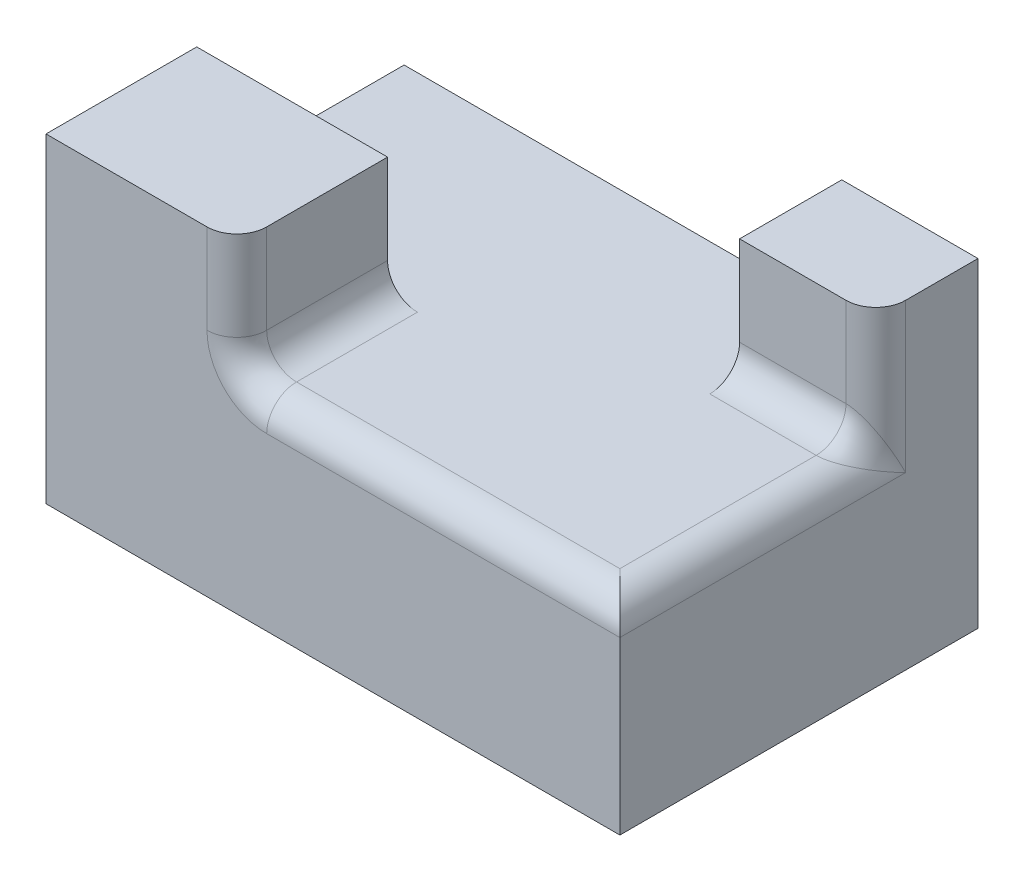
ISO-10303-21;
HEADER;
FILE_DESCRIPTION(('STEP AP214'),'2;1');
FILE_NAME('part.step','',(''),(''),'','','');
FILE_SCHEMA(('AUTOMOTIVE_DESIGN { 1 0 10303 214 1 1 1 1 }'));
ENDSEC;
DATA;
#1=APPLICATION_CONTEXT('core data for automotive mechanical design processes');
#2=APPLICATION_PROTOCOL_DEFINITION('international standard','automotive_design',2000,#1);
#3=PRODUCT_CONTEXT('',#1,'mechanical');
#4=PRODUCT('Part','Part','',(#3));
#5=PRODUCT_RELATED_PRODUCT_CATEGORY('part','',(#4));
#6=PRODUCT_DEFINITION_FORMATION('','',#4);
#7=PRODUCT_DEFINITION_CONTEXT('part definition',#1,'design');
#8=PRODUCT_DEFINITION('design','',#6,#7);
#9=PRODUCT_DEFINITION_SHAPE('','',#8);
#10=(LENGTH_UNIT() NAMED_UNIT(*) SI_UNIT(.MILLI.,.METRE.));
#11=(NAMED_UNIT(*) PLANE_ANGLE_UNIT() SI_UNIT($,.RADIAN.));
#12=(NAMED_UNIT(*) SI_UNIT($,.STERADIAN.) SOLID_ANGLE_UNIT());
#13=UNCERTAINTY_MEASURE_WITH_UNIT(LENGTH_MEASURE(1.E-05),#10,'distance_accuracy_value','');
#14=(GEOMETRIC_REPRESENTATION_CONTEXT(3) GLOBAL_UNCERTAINTY_ASSIGNED_CONTEXT((#13)) GLOBAL_UNIT_ASSIGNED_CONTEXT((#10,
#11,#12)) REPRESENTATION_CONTEXT('',''));
#15=CARTESIAN_POINT('',(0.,0.,0.));
#16=DIRECTION('',(0.,0.,1.));
#17=DIRECTION('',(1.,0.,0.));
#18=AXIS2_PLACEMENT_3D('',#15,#16,#17);
#19=CARTESIAN_POINT('',(96.1490143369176,28.6618279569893,12.1202496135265));
#20=CARTESIAN_POINT('',(96.1490143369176,28.6618279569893,12.1202496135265));
#21=CARTESIAN_POINT('',(96.1490143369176,28.6618279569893,12.1202496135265));
#22=CARTESIAN_POINT('',(96.1490080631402,28.7707616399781,12.3381169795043));
#23=CARTESIAN_POINT('',(96.1490377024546,28.8252281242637,12.283649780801));
#24=CARTESIAN_POINT('',(96.1490080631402,28.879695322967,12.2291832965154));
#25=CARTESIAN_POINT('',(96.1454544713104,28.8796796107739,12.5559529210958));
#26=CARTESIAN_POINT('',(96.1418871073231,28.9887210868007,12.447142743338));
#27=CARTESIAN_POINT('',(96.1454544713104,29.0975312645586,12.3381012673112));
#28=CARTESIAN_POINT('',(96.1312103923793,29.0972907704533,12.9911752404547));
#29=CARTESIAN_POINT('',(96.1134165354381,29.3144399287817,12.772861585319));
#30=CARTESIAN_POINT('',(96.1312103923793,29.5327535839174,12.5557124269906));
#31=CARTESIAN_POINT('',(96.1205193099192,29.2059839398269,13.2085615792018));
#32=CARTESIAN_POINT('',(96.0920548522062,29.4768961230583,12.9353177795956));
#33=CARTESIAN_POINT('',(96.1205193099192,29.7501399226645,12.6644055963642));
#34=CARTESIAN_POINT('',(96.0779288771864,29.5294979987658,13.8555896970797));
#35=CARTESIAN_POINT('',(96.0070926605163,29.958646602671,13.4170682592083));
#36=CARTESIAN_POINT('',(96.0779288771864,30.3971680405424,12.9879196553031));
#37=CARTESIAN_POINT('',(96.0355125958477,29.7436796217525,14.283952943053));
#38=CARTESIAN_POINT('',(95.9223415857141,30.2752082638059,13.7336299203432));
#39=CARTESIAN_POINT('',(96.0355125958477,30.8255312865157,13.2021012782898));
#40=CARTESIAN_POINT('',(95.9227282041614,30.1646067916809,15.1258072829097));
#41=CARTESIAN_POINT('',(95.7008351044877,30.8841688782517,14.342590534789));
#42=CARTESIAN_POINT('',(95.9227282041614,31.6673856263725,13.6230284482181));
#43=CARTESIAN_POINT('',(95.852840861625,30.3714168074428,15.5394273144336));
#44=CARTESIAN_POINT('',(95.5637556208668,31.1783980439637,14.636819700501));
#45=CARTESIAN_POINT('',(95.852840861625,32.0810056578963,13.8298384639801));
#46=CARTESIAN_POINT('',(95.6860629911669,30.7740522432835,16.344698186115));
#47=CARTESIAN_POINT('',(95.244452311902,31.7320304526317,15.190452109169));
#48=CARTESIAN_POINT('',(95.6860629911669,32.8862765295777,14.2324738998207));
#49=CARTESIAN_POINT('',(95.5898800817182,30.9700227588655,16.7366392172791));
#50=CARTESIAN_POINT('',(95.0617453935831,31.9932055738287,15.451627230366));
#51=CARTESIAN_POINT('',(95.5898800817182,33.2782175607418,14.4284444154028));
#52=CARTESIAN_POINT('',(95.3719274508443,31.3475279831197,17.4916496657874));
#53=CARTESIAN_POINT('',(94.661515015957,32.4707340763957,15.9291557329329));
#54=CARTESIAN_POINT('',(95.3719274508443,34.0332280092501,14.805949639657));
#55=CARTESIAN_POINT('',(95.2510696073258,31.5293236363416,17.8552409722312));
#56=CARTESIAN_POINT('',(94.4433664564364,32.6887553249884,16.1471769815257));
#57=CARTESIAN_POINT('',(95.2510696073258,34.3968193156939,14.9877452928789));
#58=CARTESIAN_POINT('',(94.985632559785,31.8752478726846,18.5470894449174));
#59=CARTESIAN_POINT('',(93.9867474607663,33.0715758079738,16.529997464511));
#60=CARTESIAN_POINT('',(94.985632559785,35.0886677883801,15.3336695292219));
#61=CARTESIAN_POINT('',(94.8421290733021,32.0397852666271,18.8761642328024));
#62=CARTESIAN_POINT('',(93.7475519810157,33.2378779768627,16.6962996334));
#63=CARTESIAN_POINT('',(94.8421290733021,35.4177425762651,15.4982069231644));
#64=CARTESIAN_POINT('',(94.5336806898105,32.348225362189,19.4930444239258));
#65=CARTESIAN_POINT('',(93.2679895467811,33.5118870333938,16.9703086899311));
#66=CARTESIAN_POINT('',(94.5336806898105,36.0346227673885,15.8066470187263));
#67=CARTESIAN_POINT('',(94.3699096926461,32.4927085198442,19.7820107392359));
#68=CARTESIAN_POINT('',(93.0268733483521,33.6208675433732,17.0792891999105));
#69=CARTESIAN_POINT('',(94.3699096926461,36.3235890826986,15.9511301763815));
#70=CARTESIAN_POINT('',(94.0236930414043,32.7583729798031,20.3133396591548));
#71=CARTESIAN_POINT('',(92.5666913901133,33.7802352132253,17.2386568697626));
#72=CARTESIAN_POINT('',(94.0236930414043,36.8549180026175,16.2167946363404));
#73=CARTESIAN_POINT('',(93.8424176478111,32.8803097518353,20.5572132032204));
#74=CARTESIAN_POINT('',(92.3469605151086,33.831617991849,17.2900396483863));
#75=CARTESIAN_POINT('',(93.8424176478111,37.0987915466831,16.3387314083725));
#76=CARTESIAN_POINT('',(93.4641525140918,33.0986694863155,20.9939326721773));
#77=CARTESIAN_POINT('',(91.9539994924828,33.8839523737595,17.3423740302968));
#78=CARTESIAN_POINT('',(93.4641525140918,37.53551101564,16.5570911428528));
#79=CARTESIAN_POINT('',(93.2682103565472,33.1959814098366,21.1885565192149));
#80=CARTESIAN_POINT('',(91.7802865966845,33.8856184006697,17.344040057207));
#81=CARTESIAN_POINT('',(93.2682103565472,37.7301348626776,16.6544030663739));
#82=CARTESIAN_POINT('',(92.9634821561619,33.3222155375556,21.4410247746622));
#83=CARTESIAN_POINT('',(91.5679602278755,33.8642822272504,17.3227038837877));
#84=CARTESIAN_POINT('',(92.9634821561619,37.9826031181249,16.7806371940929));
#85=CARTESIAN_POINT('',(92.862258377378,33.3604151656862,21.517424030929));
#86=CARTESIAN_POINT('',(91.5057132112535,33.853419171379,17.3118408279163));
#87=CARTESIAN_POINT('',(92.862258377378,38.0590023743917,16.8188368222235));
#88=CARTESIAN_POINT('',(92.6556569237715,33.430675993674,21.6579456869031));
#89=CARTESIAN_POINT('',(91.3965943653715,33.8268596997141,17.2852813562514));
#90=CARTESIAN_POINT('',(92.6556569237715,38.1995240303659,16.8890976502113));
#91=CARTESIAN_POINT('',(92.5502812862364,33.4627401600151,21.7220740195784));
#92=CARTESIAN_POINT('',(91.3499908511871,33.8111282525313,17.2695499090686));
#93=CARTESIAN_POINT('',(92.5502812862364,38.2636523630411,16.9211618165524));
#94=CARTESIAN_POINT('',(92.3390935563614,33.5193284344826,21.8352505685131));
#95=CARTESIAN_POINT('',(91.2737685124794,33.7785309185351,17.2369525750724));
#96=CARTESIAN_POINT('',(92.3390935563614,38.3768289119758,16.9777500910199));
#97=CARTESIAN_POINT('',(92.2333856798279,33.5440467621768,21.8846872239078));
#98=CARTESIAN_POINT('',(91.2439084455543,33.7617235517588,17.2201452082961));
#99=CARTESIAN_POINT('',(92.2333856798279,38.4262655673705,17.0024684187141));
#100=CARTESIAN_POINT('',(92.0193127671,33.5867119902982,21.9700176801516));
#101=CARTESIAN_POINT('',(91.1978030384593,33.7298203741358,17.1882420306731));
#102=CARTESIAN_POINT('',(92.0193127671,38.5115960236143,17.0451336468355));
#103=CARTESIAN_POINT('',(91.910949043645,33.6046621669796,22.005918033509));
#104=CARTESIAN_POINT('',(91.1817160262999,33.7147753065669,17.1731969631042));
#105=CARTESIAN_POINT('',(91.910949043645,38.5474963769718,17.0630838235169));
#106=CARTESIAN_POINT('',(91.6941005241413,33.6332107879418,22.0630152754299));
#107=CARTESIAN_POINT('',(91.1601582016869,33.6895473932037,17.147969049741));
#108=CARTESIAN_POINT('',(91.6941005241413,38.6045936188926,17.0916324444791));
#109=CARTESIAN_POINT('',(91.5856457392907,33.6439228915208,22.0844394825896));
#110=CARTESIAN_POINT('',(91.1546045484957,33.6793472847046,17.1377689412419));
#111=CARTESIAN_POINT('',(91.5856457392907,38.6260178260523,17.1023445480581));
#112=CARTESIAN_POINT('',(91.3677987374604,33.6582314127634,22.1130565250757));
#113=CARTESIAN_POINT('',(91.1490230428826,33.66546856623,17.1238902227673));
#114=CARTESIAN_POINT('',(91.3677987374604,38.6546348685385,17.1166530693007));
#115=CARTESIAN_POINT('',(91.258406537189,33.6618279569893,22.1202496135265));
#116=CARTESIAN_POINT('',(91.149018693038,33.6618279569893,17.1202496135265));
#117=CARTESIAN_POINT('',(91.258406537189,38.6618279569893,17.1202496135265));
#118=CARTESIAN_POINT('',(91.0396221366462,33.6618279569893,22.1202496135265));
#119=CARTESIAN_POINT('',(91.1490099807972,33.6618279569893,17.1202496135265));
#120=CARTESIAN_POINT('',(91.0396221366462,38.6618279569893,17.1202496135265));
#121=CARTESIAN_POINT('',(90.9302299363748,33.6582314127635,22.1130565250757));
#122=CARTESIAN_POINT('',(91.1490056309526,33.66546856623,17.1238902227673));
#123=CARTESIAN_POINT('',(90.9302299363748,38.6546348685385,17.1166530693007));
#124=CARTESIAN_POINT('',(90.7123829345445,33.6439228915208,22.0844394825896));
#125=CARTESIAN_POINT('',(91.1434241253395,33.6793472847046,17.1377689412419));
#126=CARTESIAN_POINT('',(90.7123829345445,38.6260178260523,17.1023445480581));
#127=CARTESIAN_POINT('',(90.6039281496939,33.6332107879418,22.0630152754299));
#128=CARTESIAN_POINT('',(91.1378704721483,33.6895473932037,17.147969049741));
#129=CARTESIAN_POINT('',(90.6039281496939,38.6045936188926,17.0916324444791));
#130=CARTESIAN_POINT('',(90.3870796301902,33.6046621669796,22.005918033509));
#131=CARTESIAN_POINT('',(91.1163126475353,33.7147753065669,17.1731969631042));
#132=CARTESIAN_POINT('',(90.3870796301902,38.5474963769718,17.0630838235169));
#133=CARTESIAN_POINT('',(90.2787159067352,33.5867119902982,21.9700176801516));
#134=CARTESIAN_POINT('',(91.1002256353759,33.7298203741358,17.1882420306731));
#135=CARTESIAN_POINT('',(90.2787159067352,38.5115960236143,17.0451336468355));
#136=CARTESIAN_POINT('',(90.0646429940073,33.5440467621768,21.8846872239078));
#137=CARTESIAN_POINT('',(91.0541202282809,33.7617235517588,17.2201452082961));
#138=CARTESIAN_POINT('',(90.0646429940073,38.4262655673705,17.0024684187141));
#139=CARTESIAN_POINT('',(89.9589351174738,33.5193284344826,21.8352505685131));
#140=CARTESIAN_POINT('',(91.0242601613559,33.7785309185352,17.2369525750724));
#141=CARTESIAN_POINT('',(89.9589351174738,38.3768289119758,16.9777500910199));
#142=CARTESIAN_POINT('',(89.7477473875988,33.4627401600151,21.7220740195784));
#143=CARTESIAN_POINT('',(90.9480378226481,33.8111282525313,17.2695499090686));
#144=CARTESIAN_POINT('',(89.7477473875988,38.2636523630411,16.9211618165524));
#145=CARTESIAN_POINT('',(89.6423717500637,33.430675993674,21.6579456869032));
#146=CARTESIAN_POINT('',(90.9014343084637,33.8268596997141,17.2852813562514));
#147=CARTESIAN_POINT('',(89.6423717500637,38.1995240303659,16.8890976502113));
#148=CARTESIAN_POINT('',(89.4357702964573,33.3604151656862,21.517424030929));
#149=CARTESIAN_POINT('',(90.7923154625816,33.853419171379,17.3118408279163));
#150=CARTESIAN_POINT('',(89.4357702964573,38.0590023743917,16.8188368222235));
#151=CARTESIAN_POINT('',(89.3345465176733,33.3222155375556,21.4410247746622));
#152=CARTESIAN_POINT('',(90.7300684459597,33.8642822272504,17.3227038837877));
#153=CARTESIAN_POINT('',(89.3345465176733,37.9826031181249,16.7806371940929));
#154=CARTESIAN_POINT('',(89.029818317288,33.1959814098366,21.1885565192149));
#155=CARTESIAN_POINT('',(90.5177420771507,33.8856184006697,17.344040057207));
#156=CARTESIAN_POINT('',(89.029818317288,37.7301348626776,16.6544030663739));
#157=CARTESIAN_POINT('',(88.8338761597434,33.0986694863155,20.9939326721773));
#158=CARTESIAN_POINT('',(90.3440291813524,33.8839523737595,17.3423740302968));
#159=CARTESIAN_POINT('',(88.8338761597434,37.53551101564,16.5570911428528));
#160=CARTESIAN_POINT('',(88.4556110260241,32.8803097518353,20.5572132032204));
#161=CARTESIAN_POINT('',(89.9510681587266,33.831617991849,17.2900396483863));
#162=CARTESIAN_POINT('',(88.4556110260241,37.0987915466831,16.3387314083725));
#163=CARTESIAN_POINT('',(88.2743356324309,32.7583729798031,20.3133396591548));
#164=CARTESIAN_POINT('',(89.7313372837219,33.7802352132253,17.2386568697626));
#165=CARTESIAN_POINT('',(88.2743356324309,36.8549180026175,16.2167946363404));
#166=CARTESIAN_POINT('',(87.9281189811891,32.4927085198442,19.7820107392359));
#167=CARTESIAN_POINT('',(89.2711553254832,33.6208675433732,17.0792891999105));
#168=CARTESIAN_POINT('',(87.9281189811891,36.3235890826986,15.9511301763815));
#169=CARTESIAN_POINT('',(87.7643479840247,32.348225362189,19.4930444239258));
#170=CARTESIAN_POINT('',(89.0300391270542,33.5118870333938,16.9703086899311));
#171=CARTESIAN_POINT('',(87.7643479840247,36.0346227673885,15.8066470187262));
#172=CARTESIAN_POINT('',(87.4558996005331,32.0397852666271,18.8761642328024));
#173=CARTESIAN_POINT('',(88.5504766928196,33.2378779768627,16.6962996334));
#174=CARTESIAN_POINT('',(87.4558996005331,35.4177425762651,15.4982069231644));
#175=CARTESIAN_POINT('',(87.3123961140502,31.8752478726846,18.5470894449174));
#176=CARTESIAN_POINT('',(88.3112812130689,33.0715758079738,16.529997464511));
#177=CARTESIAN_POINT('',(87.3123961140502,35.0886677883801,15.3336695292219));
#178=CARTESIAN_POINT('',(87.0469590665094,31.5293236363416,17.8552409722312));
#179=CARTESIAN_POINT('',(87.8546622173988,32.6887553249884,16.1471769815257));
#180=CARTESIAN_POINT('',(87.0469590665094,34.3968193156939,14.9877452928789));
#181=CARTESIAN_POINT('',(86.9261012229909,31.3475279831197,17.4916496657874));
#182=CARTESIAN_POINT('',(87.6365136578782,32.4707340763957,15.929155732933));
#183=CARTESIAN_POINT('',(86.9261012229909,34.0332280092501,14.805949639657));
#184=CARTESIAN_POINT('',(86.708148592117,30.9700227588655,16.7366392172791));
#185=CARTESIAN_POINT('',(87.2362832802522,31.9932055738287,15.451627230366));
#186=CARTESIAN_POINT('',(86.708148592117,33.2782175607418,14.4284444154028));
#187=CARTESIAN_POINT('',(86.6119656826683,30.7740522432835,16.344698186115));
#188=CARTESIAN_POINT('',(87.0535763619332,31.7320304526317,15.190452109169));
#189=CARTESIAN_POINT('',(86.6119656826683,32.8862765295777,14.2324738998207));
#190=CARTESIAN_POINT('',(86.4451878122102,30.3714168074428,15.5394273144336));
#191=CARTESIAN_POINT('',(86.7342730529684,31.1783980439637,14.636819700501));
#192=CARTESIAN_POINT('',(86.4451878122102,32.0810056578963,13.8298384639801));
#193=CARTESIAN_POINT('',(86.3753004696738,30.1646067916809,15.1258072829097));
#194=CARTESIAN_POINT('',(86.5971935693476,30.8841688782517,14.342590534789));
#195=CARTESIAN_POINT('',(86.3753004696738,31.6673856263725,13.6230284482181));
#196=CARTESIAN_POINT('',(86.2625160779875,29.7436796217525,14.283952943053));
#197=CARTESIAN_POINT('',(86.3756870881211,30.2752082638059,13.7336299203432));
#198=CARTESIAN_POINT('',(86.2625160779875,30.8255312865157,13.2021012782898));
#199=CARTESIAN_POINT('',(86.2200997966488,29.5294979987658,13.8555896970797));
#200=CARTESIAN_POINT('',(86.2909360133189,29.958646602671,13.4170682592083));
#201=CARTESIAN_POINT('',(86.2200997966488,30.3971680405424,12.9879196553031));
#202=CARTESIAN_POINT('',(86.177509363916,29.2059839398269,13.2085615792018));
#203=CARTESIAN_POINT('',(86.205973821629,29.4768961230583,12.9353177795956));
#204=CARTESIAN_POINT('',(86.177509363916,29.7501399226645,12.6644055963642));
#205=CARTESIAN_POINT('',(86.1668182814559,29.0972907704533,12.9911752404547));
#206=CARTESIAN_POINT('',(86.1846121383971,29.3144399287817,12.772861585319));
#207=CARTESIAN_POINT('',(86.1668182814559,29.5327535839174,12.5557124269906));
#208=CARTESIAN_POINT('',(86.1525742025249,28.8796796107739,12.5559529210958));
#209=CARTESIAN_POINT('',(86.156141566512,28.9887210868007,12.447142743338));
#210=CARTESIAN_POINT('',(86.1525742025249,29.0975312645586,12.3381012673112));
#211=CARTESIAN_POINT('',(86.149020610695,28.7707616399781,12.3381169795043));
#212=CARTESIAN_POINT('',(86.1489909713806,28.8252281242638,12.283649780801));
#213=CARTESIAN_POINT('',(86.149020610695,28.879695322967,12.2291832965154));
#214=CARTESIAN_POINT('',(86.1490143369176,28.6618279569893,12.1202496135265));
#215=CARTESIAN_POINT('',(86.1490143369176,28.6618279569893,12.1202496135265));
#216=CARTESIAN_POINT('',(86.1490143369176,28.6618279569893,12.1202496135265));
#217=(BOUNDED_SURFACE() B_SPLINE_SURFACE(3,2,((#19,#20,#21),(#22,#23,#24),(#25,#26,#27),(#28,
#29,#30),(#31,#32,#33),(#34,#35,#36),(#37,#38,#39),(#40,#41,#42),(#43,#44,#45),(#46,#47,#48),
(#49,#50,#51),(#52,#53,#54),(#55,#56,#57),(#58,#59,#60),(#61,#62,#63),(#64,#65,#66),(#67,#68,
#69),(#70,#71,#72),(#73,#74,#75),(#76,#77,#78),(#79,#80,#81),(#82,#83,#84),(#85,#86,#87),(#88,
#89,#90),(#91,#92,#93),(#94,#95,#96),(#97,#98,#99),(#100,#101,#102),(#103,#104,#105),(#106,#107,
#108),(#109,#110,#111),(#112,#113,#114),(#115,#116,#117),(#118,#119,#120),(#121,#122,#123),
(#124,#125,#126),(#127,#128,#129),(#130,#131,#132),(#133,#134,#135),(#136,#137,#138),(#139,#140,
#141),(#142,#143,#144),(#145,#146,#147),(#148,#149,#150),(#151,#152,#153),(#154,#155,#156),
(#157,#158,#159),(#160,#161,#162),(#163,#164,#165),(#166,#167,#168),(#169,#170,#171),(#172,#173,
#174),(#175,#176,#177),(#178,#179,#180),(#181,#182,#183),(#184,#185,#186),(#187,#188,#189),
(#190,#191,#192),(#193,#194,#195),(#196,#197,#198),(#199,#200,#201),(#202,#203,#204),(#205,#206,
#207),(#208,#209,#210),(#211,#212,#213),(#214,#215,#216)),.UNSPECIFIED.,.F.,.F.,
.F.) B_SPLINE_SURFACE_WITH_KNOTS((4,2,2,2,2,2,2,2,2,2,2,2,2,2,2,2,2,2,2,2,2,2,2,2,2,2,2,2,2,2,2,
2,4),(3,3),(0.,0.924160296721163,1.84839768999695,3.68059127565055,5.48205356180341,
7.23913791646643,8.94029416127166,10.5768174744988,12.1436214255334,13.6400005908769,
15.0702934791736,15.7580538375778,16.4454808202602,17.1126662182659,17.7795282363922,
18.4356587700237,19.0917776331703,19.7478964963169,20.4040270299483,21.0708890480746,
21.7380744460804,22.4255014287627,23.1132617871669,24.5435546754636,26.0399338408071,
27.6067377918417,29.2432611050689,30.9444173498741,32.7015017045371,34.50296399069,
36.3351575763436,37.2593949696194,38.1835552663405),(0.,1.),
.UNSPECIFIED.) GEOMETRIC_REPRESENTATION_ITEM() RATIONAL_B_SPLINE_SURFACE(((1.,1.,1.),(1.,
0.999999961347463,1.),(1.,0.999643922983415,1.),(1.,0.998220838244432,1.),(1.,0.9971537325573,
1.),(1.,0.992912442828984,1.),(1.,0.988698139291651,1.),(1.,0.97761667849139,1.),(1.,
0.970795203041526,1.),(1.,0.954789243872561,1.),(1.,0.945667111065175,1.),(1.,0.925487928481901,
1.),(1.,0.914501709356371,1.),(1.,0.891170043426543,1.),(1.,0.878892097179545,1.),(1.,
0.853706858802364,1.),(1.,0.840848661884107,1.),(1.,0.815387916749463,1.),(1.,0.802799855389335,
1.),(1.,0.778879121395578,1.),(1.,0.767515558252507,1.),(1.,0.752114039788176,1.),(1.,
0.747335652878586,1.),(1.,0.738380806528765,1.),(1.,0.734204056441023,1.),(1.,0.726720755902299,
1.),(1.,0.723392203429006,1.),(1.,0.717584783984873,1.),(1.,0.715105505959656,1.),(1.,
0.711136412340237,1.),(1.,0.709631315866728,1.),(1.,0.70761650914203,1.),(1.,0.707106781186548,
1.),(1.,0.707106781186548,1.),(1.,0.70761650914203,1.),(1.,0.709631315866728,1.),(1.,
0.711136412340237,1.),(1.,0.715105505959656,1.),(1.,0.717584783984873,1.),(1.,0.723392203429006,
1.),(1.,0.726720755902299,1.),(1.,0.734204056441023,1.),(1.,0.738380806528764,1.),(1.,
0.747335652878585,1.),(1.,0.752114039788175,1.),(1.,0.767515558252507,1.),(1.,0.778879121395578,
1.),(1.,0.802799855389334,1.),(1.,0.815387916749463,1.),(1.,0.840848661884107,1.),(1.,
0.853706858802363,1.),(1.,0.878892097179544,1.),(1.,0.891170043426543,1.),(1.,0.914501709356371,
1.),(1.,0.925487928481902,1.),(1.,0.945667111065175,1.),(1.,0.954789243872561,1.),(1.,
0.970795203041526,1.),(1.,0.97761667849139,1.),(1.,0.988698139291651,1.),(1.,0.992912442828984,
1.),(1.,0.9971537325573,1.),(1.,0.998220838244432,1.),(1.,0.999643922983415,1.),(1.,
0.999999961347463,1.),(1.,1.,1.))) REPRESENTATION_ITEM('') SURFACE());
#218=CARTESIAN_POINT('',(91.1490143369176,38.6618279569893,22.1202496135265));
#219=DIRECTION('',(-1.,0.,0.));
#220=DIRECTION('',(0.,0.,1.));
#221=AXIS2_PLACEMENT_3D('',#218,#219,#220);
#222=CIRCLE('',#221,5.);
#223=CARTESIAN_POINT('',(91.1490143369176,38.6618279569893,17.1202496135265));
#224=VERTEX_POINT('',#223);
#225=CARTESIAN_POINT('',(91.1490143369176,33.6618279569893,22.1202496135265));
#226=VERTEX_POINT('',#225);
#227=EDGE_CURVE('E117',#224,#226,#222,.T.);
#228=ORIENTED_EDGE('',*,*,#227,.T.);
#229=CARTESIAN_POINT('',(91.1490143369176,28.6618279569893,12.1202496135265));
#230=DIRECTION('',(0.,0.894427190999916,-0.447213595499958));
#231=DIRECTION('',(0.,-0.447213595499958,-0.894427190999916));
#232=AXIS2_PLACEMENT_3D('',#229,#230,#231);
#233=ELLIPSE('',#232,11.1803398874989,5.);
#234=CARTESIAN_POINT('',(96.1490143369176,28.6618279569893,12.1202496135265));
#235=VERTEX_POINT('',#234);
#236=EDGE_CURVE('E124',#235,#226,#233,.F.);
#237=ORIENTED_EDGE('',*,*,#236,.F.);
#238=CARTESIAN_POINT('',(91.1490143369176,28.6618279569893,12.1202496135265));
#239=DIRECTION('',(0.,0.447213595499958,-0.894427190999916));
#240=DIRECTION('',(0.,-0.894427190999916,-0.447213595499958));
#241=AXIS2_PLACEMENT_3D('',#238,#239,#240);
#242=ELLIPSE('',#241,11.1803398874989,5.);
#243=EDGE_CURVE('E131',#224,#235,#242,.T.);
#244=ORIENTED_EDGE('',*,*,#243,.F.);
#245=EDGE_LOOP('',(#228,#237,#244));
#246=FACE_BOUND('',#245,.T.);
#247=ADVANCED_FACE('F41',(#246),#217,.F.);
#248=CARTESIAN_POINT('',(0.,33.6618279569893,60.));
#249=DIRECTION('',(0.,-1.,0.));
#250=DIRECTION('',(0.,0.,-1.));
#251=AXIS2_PLACEMENT_3D('',#248,#249,#250);
#252=PLANE('',#251);
#253=DIRECTION('',(0.,0.,-1.));
#254=VECTOR('',#253,1.);
#255=CARTESIAN_POINT('',(91.1490143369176,33.6618279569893,60.));
#256=LINE('',#255,#254);
#257=CARTESIAN_POINT('',(91.1490143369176,33.6618279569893,55.));
#258=VERTEX_POINT('',#257);
#259=EDGE_CURVE('E96',#258,#226,#256,.T.);
#260=ORIENTED_EDGE('',*,*,#259,.T.);
#261=DIRECTION('',(1.,0.,0.));
#262=VECTOR('',#261,1.);
#263=CARTESIAN_POINT('',(73.3247964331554,33.6618279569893,22.1202496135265));
#264=LINE('',#263,#262);
#265=CARTESIAN_POINT('',(73.3247964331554,33.6618279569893,22.1202496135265));
#266=VERTEX_POINT('',#265);
#267=EDGE_CURVE('E101',#226,#266,#264,.F.);
#268=ORIENTED_EDGE('',*,*,#267,.T.);
#269=DIRECTION('',(0.,0.,1.));
#270=VECTOR('',#269,1.);
#271=CARTESIAN_POINT('',(73.3247964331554,33.6618279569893,0.));
#272=LINE('',#271,#270);
#273=CARTESIAN_POINT('',(73.3247964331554,33.6618279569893,0.));
#274=VERTEX_POINT('',#273);
#275=EDGE_CURVE('E149',#274,#266,#272,.T.);
#276=ORIENTED_EDGE('',*,*,#275,.F.);
#277=DIRECTION('',(-1.,0.,0.));
#278=VECTOR('',#277,1.);
#279=CARTESIAN_POINT('',(0.,33.6618279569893,0.));
#280=LINE('',#279,#278);
#281=CARTESIAN_POINT('',(0.,33.6618279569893,0.));
#282=VERTEX_POINT('',#281);
#283=EDGE_CURVE('E226',#274,#282,#280,.T.);
#284=ORIENTED_EDGE('',*,*,#283,.T.);
#285=DIRECTION('',(0.,0.,-1.));
#286=VECTOR('',#285,1.);
#287=CARTESIAN_POINT('',(0.,33.6618279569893,60.));
#288=LINE('',#287,#286);
#289=CARTESIAN_POINT('',(0.,33.6618279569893,34.7454000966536));
#290=VERTEX_POINT('',#289);
#291=EDGE_CURVE('E210',#290,#282,#288,.T.);
#292=ORIENTED_EDGE('',*,*,#291,.F.);
#293=DIRECTION('',(-1.,0.,0.));
#294=VECTOR('',#293,1.);
#295=CARTESIAN_POINT('',(0.,33.6618279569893,34.7454000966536));
#296=LINE('',#295,#294);
#297=CARTESIAN_POINT('',(36.9746669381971,33.6618279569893,34.7454000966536));
#298=VERTEX_POINT('',#297);
#299=EDGE_CURVE('E203',#298,#290,#296,.T.);
#300=ORIENTED_EDGE('',*,*,#299,.F.);
#301=DIRECTION('',(0.,0.,-1.));
#302=VECTOR('',#301,1.);
#303=CARTESIAN_POINT('',(36.9746669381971,33.6618279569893,60.));
#304=LINE('',#303,#302);
#305=CARTESIAN_POINT('',(36.9746669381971,33.6618279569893,55.));
#306=VERTEX_POINT('',#305);
#307=EDGE_CURVE('E182',#298,#306,#304,.F.);
#308=ORIENTED_EDGE('',*,*,#307,.T.);
#309=DIRECTION('',(-1.,0.,0.));
#310=VECTOR('',#309,1.);
#311=CARTESIAN_POINT('',(0.,33.6618279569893,55.));
#312=LINE('',#311,#310);
#313=EDGE_CURVE('E104',#306,#258,#312,.F.);
#314=ORIENTED_EDGE('',*,*,#313,.T.);
#315=EDGE_LOOP('',(#260,#268,#276,#284,#292,#300,#308,#314));
#316=FACE_BOUND('',#315,.T.);
#317=ADVANCED_FACE('F98',(#316),#252,.F.);
#318=CARTESIAN_POINT('',(0.,0.,60.));
#319=DIRECTION('',(1.,0.,0.));
#320=DIRECTION('',(0.,0.,-1.));
#321=AXIS2_PLACEMENT_3D('',#318,#319,#320);
#322=PLANE('',#321);
#323=DIRECTION('',(0.,-1.,0.));
#324=VECTOR('',#323,1.);
#325=CARTESIAN_POINT('',(0.,0.,0.));
#326=LINE('',#325,#324);
#327=CARTESIAN_POINT('',(0.,0.,0.));
#328=VERTEX_POINT('',#327);
#329=EDGE_CURVE('E220',#282,#328,#326,.T.);
#330=ORIENTED_EDGE('',*,*,#329,.T.);
#331=DIRECTION('',(0.,0.,-1.));
#332=VECTOR('',#331,1.);
#333=CARTESIAN_POINT('',(0.,0.,60.));
#334=LINE('',#333,#332);
#335=CARTESIAN_POINT('',(0.,0.,60.));
#336=VERTEX_POINT('',#335);
#337=EDGE_CURVE('E194',#336,#328,#334,.T.);
#338=ORIENTED_EDGE('',*,*,#337,.F.);
#339=DIRECTION('',(0.,-1.,0.));
#340=VECTOR('',#339,1.);
#341=CARTESIAN_POINT('',(0.,0.,60.));
#342=LINE('',#341,#340);
#343=CARTESIAN_POINT('',(0.,53.6618279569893,60.));
#344=VERTEX_POINT('',#343);
#345=EDGE_CURVE('E221',#344,#336,#342,.T.);
#346=ORIENTED_EDGE('',*,*,#345,.F.);
#347=DIRECTION('',(0.,0.,1.));
#348=VECTOR('',#347,1.);
#349=CARTESIAN_POINT('',(0.,53.6618279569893,60.));
#350=LINE('',#349,#348);
#351=CARTESIAN_POINT('',(0.,53.6618279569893,34.7454000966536));
#352=VERTEX_POINT('',#351);
#353=EDGE_CURVE('E208',#352,#344,#350,.T.);
#354=ORIENTED_EDGE('',*,*,#353,.F.);
#355=DIRECTION('',(0.,-1.,0.));
#356=VECTOR('',#355,1.);
#357=CARTESIAN_POINT('',(0.,53.6618279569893,34.7454000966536));
#358=LINE('',#357,#356);
#359=EDGE_CURVE('E197',#352,#290,#358,.T.);
#360=ORIENTED_EDGE('',*,*,#359,.T.);
#361=ORIENTED_EDGE('',*,*,#291,.T.);
#362=EDGE_LOOP('',(#330,#338,#346,#354,#360,#361));
#363=FACE_BOUND('',#362,.T.);
#364=ADVANCED_FACE('F269',(#363),#322,.F.);
#365=CARTESIAN_POINT('',(0.,0.,60.));
#366=DIRECTION('',(0.,1.,0.));
#367=DIRECTION('',(0.,0.,1.));
#368=AXIS2_PLACEMENT_3D('',#365,#366,#367);
#369=PLANE('',#368);
#370=DIRECTION('',(1.,0.,0.));
#371=VECTOR('',#370,1.);
#372=CARTESIAN_POINT('',(0.,0.,0.));
#373=LINE('',#372,#371);
#374=CARTESIAN_POINT('',(96.1490143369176,0.,0.));
#375=VERTEX_POINT('',#374);
#376=EDGE_CURVE('E237',#328,#375,#373,.T.);
#377=ORIENTED_EDGE('',*,*,#376,.T.);
#378=DIRECTION('',(0.,0.,-1.));
#379=VECTOR('',#378,1.);
#380=CARTESIAN_POINT('',(96.1490143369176,0.,60.));
#381=LINE('',#380,#379);
#382=CARTESIAN_POINT('',(96.1490143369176,0.,60.));
#383=VERTEX_POINT('',#382);
#384=EDGE_CURVE('E249',#383,#375,#381,.T.);
#385=ORIENTED_EDGE('',*,*,#384,.F.);
#386=DIRECTION('',(1.,0.,0.));
#387=VECTOR('',#386,1.);
#388=CARTESIAN_POINT('',(0.,0.,60.));
#389=LINE('',#388,#387);
#390=EDGE_CURVE('E225',#336,#383,#389,.T.);
#391=ORIENTED_EDGE('',*,*,#390,.F.);
#392=ORIENTED_EDGE('',*,*,#337,.T.);
#393=EDGE_LOOP('',(#377,#385,#391,#392));
#394=FACE_BOUND('',#393,.T.);
#395=ADVANCED_FACE('F258',(#394),#369,.F.);
#396=CARTESIAN_POINT('',(96.1490143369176,0.,60.));
#397=DIRECTION('',(-1.,0.,0.));
#398=DIRECTION('',(0.,0.,1.));
#399=AXIS2_PLACEMENT_3D('',#396,#397,#398);
#400=PLANE('',#399);
#401=DIRECTION('',(0.,-1.,0.));
#402=VECTOR('',#401,1.);
#403=CARTESIAN_POINT('',(96.1490143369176,0.,12.1202496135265));
#404=LINE('',#403,#402);
#405=CARTESIAN_POINT('',(96.1490143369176,53.6618279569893,12.1202496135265));
#406=VERTEX_POINT('',#405);
#407=EDGE_CURVE('E110',#406,#235,#404,.T.);
#408=ORIENTED_EDGE('',*,*,#407,.T.);
#409=DIRECTION('',(0.,0.,-1.));
#410=VECTOR('',#409,1.);
#411=CARTESIAN_POINT('',(96.1490143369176,28.6618279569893,60.));
#412=LINE('',#411,#410);
#413=CARTESIAN_POINT('',(96.1490143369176,28.6618279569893,60.));
#414=VERTEX_POINT('',#413);
#415=EDGE_CURVE('E127',#235,#414,#412,.F.);
#416=ORIENTED_EDGE('',*,*,#415,.T.);
#417=DIRECTION('',(0.,1.,0.));
#418=VECTOR('',#417,1.);
#419=CARTESIAN_POINT('',(96.1490143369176,0.,60.));
#420=LINE('',#419,#418);
#421=EDGE_CURVE('E230',#383,#414,#420,.T.);
#422=ORIENTED_EDGE('',*,*,#421,.F.);
#423=ORIENTED_EDGE('',*,*,#384,.T.);
#424=DIRECTION('',(0.,1.,0.));
#425=VECTOR('',#424,1.);
#426=CARTESIAN_POINT('',(96.1490143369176,0.,0.));
#427=LINE('',#426,#425);
#428=CARTESIAN_POINT('',(96.1490143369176,53.6618279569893,0.));
#429=VERTEX_POINT('',#428);
#430=EDGE_CURVE('E241',#375,#429,#427,.T.);
#431=ORIENTED_EDGE('',*,*,#430,.T.);
#432=DIRECTION('',(0.,0.,-1.));
#433=VECTOR('',#432,1.);
#434=CARTESIAN_POINT('',(96.1490143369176,53.6618279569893,0.));
#435=LINE('',#434,#433);
#436=EDGE_CURVE('E303',#406,#429,#435,.T.);
#437=ORIENTED_EDGE('',*,*,#436,.F.);
#438=EDGE_LOOP('',(#408,#416,#422,#423,#431,#437));
#439=FACE_BOUND('',#438,.T.);
#440=ADVANCED_FACE('F309',(#439),#400,.F.);
#441=CARTESIAN_POINT('',(0.,33.6618279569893,60.));
#442=DIRECTION('',(0.,0.,-1.));
#443=DIRECTION('',(-1.,0.,0.));
#444=AXIS2_PLACEMENT_3D('',#441,#442,#443);
#445=PLANE('',#444);
#446=DIRECTION('',(-1.,0.,0.));
#447=VECTOR('',#446,1.);
#448=CARTESIAN_POINT('',(0.,28.6618279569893,60.));
#449=LINE('',#448,#447);
#450=CARTESIAN_POINT('',(36.9746669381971,28.6618279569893,60.));
#451=VERTEX_POINT('',#450);
#452=EDGE_CURVE('E175',#414,#451,#449,.T.);
#453=ORIENTED_EDGE('',*,*,#452,.T.);
#454=CARTESIAN_POINT('',(36.9746669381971,38.6618279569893,60.));
#455=DIRECTION('',(0.,0.,-1.));
#456=DIRECTION('',(-1.,0.,0.));
#457=AXIS2_PLACEMENT_3D('',#454,#455,#456);
#458=CIRCLE('',#457,10.);
#459=CARTESIAN_POINT('',(26.9746669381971,38.6618279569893,60.));
#460=VERTEX_POINT('',#459);
#461=EDGE_CURVE('E141',#451,#460,#458,.T.);
#462=ORIENTED_EDGE('',*,*,#461,.T.);
#463=DIRECTION('',(0.,-1.,0.));
#464=VECTOR('',#463,1.);
#465=CARTESIAN_POINT('',(26.9746669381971,33.6618279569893,60.));
#466=LINE('',#465,#464);
#467=CARTESIAN_POINT('',(26.9746669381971,53.6618279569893,60.));
#468=VERTEX_POINT('',#467);
#469=EDGE_CURVE('E178',#460,#468,#466,.F.);
#470=ORIENTED_EDGE('',*,*,#469,.T.);
#471=DIRECTION('',(1.,0.,0.));
#472=VECTOR('',#471,1.);
#473=CARTESIAN_POINT('',(0.,53.6618279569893,60.));
#474=LINE('',#473,#472);
#475=EDGE_CURVE('E403',#344,#468,#474,.T.);
#476=ORIENTED_EDGE('',*,*,#475,.F.);
#477=ORIENTED_EDGE('',*,*,#345,.T.);
#478=ORIENTED_EDGE('',*,*,#390,.T.);
#479=ORIENTED_EDGE('',*,*,#421,.T.);
#480=EDGE_LOOP('',(#453,#462,#470,#476,#477,#478,#479));
#481=FACE_BOUND('',#480,.T.);
#482=ADVANCED_FACE('F336',(#481),#445,.F.);
#483=CARTESIAN_POINT('',(0.,33.6618279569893,0.));
#484=DIRECTION('',(0.,0.,-1.));
#485=DIRECTION('',(-1.,0.,0.));
#486=AXIS2_PLACEMENT_3D('',#483,#484,#485);
#487=PLANE('',#486);
#488=ORIENTED_EDGE('',*,*,#329,.F.);
#489=ORIENTED_EDGE('',*,*,#283,.F.);
#490=DIRECTION('',(0.,-1.,0.));
#491=VECTOR('',#490,1.);
#492=CARTESIAN_POINT('',(73.3247964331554,53.6618279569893,0.));
#493=LINE('',#492,#491);
#494=CARTESIAN_POINT('',(73.3247964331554,53.6618279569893,0.));
#495=VERTEX_POINT('',#494);
#496=EDGE_CURVE('E209',#495,#274,#493,.T.);
#497=ORIENTED_EDGE('',*,*,#496,.F.);
#498=DIRECTION('',(-1.,0.,0.));
#499=VECTOR('',#498,1.);
#500=CARTESIAN_POINT('',(96.1490143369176,53.6618279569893,0.));
#501=LINE('',#500,#499);
#502=EDGE_CURVE('E312',#429,#495,#501,.T.);
#503=ORIENTED_EDGE('',*,*,#502,.F.);
#504=ORIENTED_EDGE('',*,*,#430,.F.);
#505=ORIENTED_EDGE('',*,*,#376,.F.);
#506=EDGE_LOOP('',(#488,#489,#497,#503,#504,#505));
#507=FACE_BOUND('',#506,.T.);
#508=ADVANCED_FACE('F274',(#507),#487,.T.);
#509=CARTESIAN_POINT('',(31.9746669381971,53.6618279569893,60.));
#510=DIRECTION('',(-1.,0.,0.));
#511=DIRECTION('',(0.,0.,1.));
#512=AXIS2_PLACEMENT_3D('',#509,#510,#511);
#513=PLANE('',#512);
#514=DIRECTION('',(0.,-1.,0.));
#515=VECTOR('',#514,1.);
#516=CARTESIAN_POINT('',(31.9746669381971,53.6618279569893,55.));
#517=LINE('',#516,#515);
#518=CARTESIAN_POINT('',(31.9746669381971,53.6618279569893,55.));
#519=VERTEX_POINT('',#518);
#520=CARTESIAN_POINT('',(31.9746669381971,38.6618279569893,55.));
#521=VERTEX_POINT('',#520);
#522=EDGE_CURVE('E191',#519,#521,#517,.T.);
#523=ORIENTED_EDGE('',*,*,#522,.T.);
#524=DIRECTION('',(0.,0.,-1.));
#525=VECTOR('',#524,1.);
#526=CARTESIAN_POINT('',(31.9746669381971,38.6618279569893,34.7454000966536));
#527=LINE('',#526,#525);
#528=CARTESIAN_POINT('',(31.9746669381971,38.6618279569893,34.7454000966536));
#529=VERTEX_POINT('',#528);
#530=EDGE_CURVE('E187',#521,#529,#527,.T.);
#531=ORIENTED_EDGE('',*,*,#530,.T.);
#532=DIRECTION('',(0.,-1.,0.));
#533=VECTOR('',#532,1.);
#534=CARTESIAN_POINT('',(31.9746669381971,53.6618279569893,34.7454000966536));
#535=LINE('',#534,#533);
#536=CARTESIAN_POINT('',(31.9746669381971,53.6618279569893,34.7454000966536));
#537=VERTEX_POINT('',#536);
#538=EDGE_CURVE('E201',#537,#529,#535,.T.);
#539=ORIENTED_EDGE('',*,*,#538,.F.);
#540=DIRECTION('',(0.,0.,-1.));
#541=VECTOR('',#540,1.);
#542=CARTESIAN_POINT('',(31.9746669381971,53.6618279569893,60.));
#543=LINE('',#542,#541);
#544=EDGE_CURVE('E405',#519,#537,#543,.T.);
#545=ORIENTED_EDGE('',*,*,#544,.F.);
#546=EDGE_LOOP('',(#523,#531,#539,#545));
#547=FACE_BOUND('',#546,.T.);
#548=ADVANCED_FACE('F420',(#547),#513,.F.);
#549=CARTESIAN_POINT('',(0.,53.6618279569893,34.7454000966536));
#550=DIRECTION('',(0.,0.,1.));
#551=DIRECTION('',(1.,0.,0.));
#552=AXIS2_PLACEMENT_3D('',#549,#550,#551);
#553=PLANE('',#552);
#554=ORIENTED_EDGE('',*,*,#299,.T.);
#555=ORIENTED_EDGE('',*,*,#359,.F.);
#556=DIRECTION('',(-1.,0.,0.));
#557=VECTOR('',#556,1.);
#558=CARTESIAN_POINT('',(0.,53.6618279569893,34.7454000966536));
#559=LINE('',#558,#557);
#560=EDGE_CURVE('E202',#537,#352,#559,.T.);
#561=ORIENTED_EDGE('',*,*,#560,.F.);
#562=ORIENTED_EDGE('',*,*,#538,.T.);
#563=CARTESIAN_POINT('',(36.9746669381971,38.6618279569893,34.7454000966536));
#564=DIRECTION('',(0.,0.,1.));
#565=DIRECTION('',(1.,0.,0.));
#566=AXIS2_PLACEMENT_3D('',#563,#564,#565);
#567=CIRCLE('',#566,5.);
#568=EDGE_CURVE('E120',#529,#298,#567,.T.);
#569=ORIENTED_EDGE('',*,*,#568,.T.);
#570=EDGE_LOOP('',(#554,#555,#561,#562,#569));
#571=FACE_BOUND('',#570,.T.);
#572=ADVANCED_FACE('F416',(#571),#553,.F.);
#573=CARTESIAN_POINT('',(0.,53.6618279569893,34.7454000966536));
#574=DIRECTION('',(0.,-1.,0.));
#575=DIRECTION('',(0.,0.,-1.));
#576=AXIS2_PLACEMENT_3D('',#573,#574,#575);
#577=PLANE('',#576);
#578=ORIENTED_EDGE('',*,*,#475,.T.);
#579=CARTESIAN_POINT('',(26.9746669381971,53.6618279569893,55.));
#580=DIRECTION('',(0.,-1.,0.));
#581=DIRECTION('',(0.,0.,-1.));
#582=AXIS2_PLACEMENT_3D('',#579,#580,#581);
#583=CIRCLE('',#582,5.);
#584=EDGE_CURVE('E171',#468,#519,#583,.F.);
#585=ORIENTED_EDGE('',*,*,#584,.T.);
#586=ORIENTED_EDGE('',*,*,#544,.T.);
#587=ORIENTED_EDGE('',*,*,#560,.T.);
#588=ORIENTED_EDGE('',*,*,#353,.T.);
#589=EDGE_LOOP('',(#578,#585,#586,#587,#588));
#590=FACE_BOUND('',#589,.T.);
#591=ADVANCED_FACE('F413',(#590),#577,.F.);
#592=CARTESIAN_POINT('',(73.3247964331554,53.6618279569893,0.));
#593=DIRECTION('',(1.,0.,0.));
#594=DIRECTION('',(0.,0.,-1.));
#595=AXIS2_PLACEMENT_3D('',#592,#593,#594);
#596=PLANE('',#595);
#597=ORIENTED_EDGE('',*,*,#275,.T.);
#598=CARTESIAN_POINT('',(73.3247964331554,38.6618279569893,22.1202496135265));
#599=DIRECTION('',(1.,0.,0.));
#600=DIRECTION('',(0.,0.,-1.));
#601=AXIS2_PLACEMENT_3D('',#598,#599,#600);
#602=CIRCLE('',#601,5.);
#603=CARTESIAN_POINT('',(73.3247964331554,38.6618279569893,17.1202496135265));
#604=VERTEX_POINT('',#603);
#605=EDGE_CURVE('E11',#266,#604,#602,.T.);
#606=ORIENTED_EDGE('',*,*,#605,.T.);
#607=DIRECTION('',(0.,-1.,0.));
#608=VECTOR('',#607,1.);
#609=CARTESIAN_POINT('',(73.3247964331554,53.6618279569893,17.1202496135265));
#610=LINE('',#609,#608);
#611=CARTESIAN_POINT('',(73.3247964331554,53.6618279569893,17.1202496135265));
#612=VERTEX_POINT('',#611);
#613=EDGE_CURVE('E388',#612,#604,#610,.T.);
#614=ORIENTED_EDGE('',*,*,#613,.F.);
#615=DIRECTION('',(0.,0.,1.));
#616=VECTOR('',#615,1.);
#617=CARTESIAN_POINT('',(73.3247964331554,53.6618279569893,0.));
#618=LINE('',#617,#616);
#619=EDGE_CURVE('E383',#495,#612,#618,.T.);
#620=ORIENTED_EDGE('',*,*,#619,.F.);
#621=ORIENTED_EDGE('',*,*,#496,.T.);
#622=EDGE_LOOP('',(#597,#606,#614,#620,#621));
#623=FACE_BOUND('',#622,.T.);
#624=ADVANCED_FACE('F390',(#623),#596,.F.);
#625=CARTESIAN_POINT('',(96.1490143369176,53.6618279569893,17.1202496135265));
#626=DIRECTION('',(0.,0.,-1.));
#627=DIRECTION('',(-1.,0.,0.));
#628=AXIS2_PLACEMENT_3D('',#625,#626,#627);
#629=PLANE('',#628);
#630=DIRECTION('',(1.,0.,0.));
#631=VECTOR('',#630,1.);
#632=CARTESIAN_POINT('',(96.1490143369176,38.6618279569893,17.1202496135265));
#633=LINE('',#632,#631);
#634=EDGE_CURVE('E156',#604,#224,#633,.T.);
#635=ORIENTED_EDGE('',*,*,#634,.T.);
#636=DIRECTION('',(0.,-1.,0.));
#637=VECTOR('',#636,1.);
#638=CARTESIAN_POINT('',(91.1490143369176,53.6618279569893,17.1202496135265));
#639=LINE('',#638,#637);
#640=CARTESIAN_POINT('',(91.1490143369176,53.6618279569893,17.1202496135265));
#641=VERTEX_POINT('',#640);
#642=EDGE_CURVE('E89',#224,#641,#639,.F.);
#643=ORIENTED_EDGE('',*,*,#642,.T.);
#644=DIRECTION('',(1.,0.,0.));
#645=VECTOR('',#644,1.);
#646=CARTESIAN_POINT('',(96.1490143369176,53.6618279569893,17.1202496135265));
#647=LINE('',#646,#645);
#648=EDGE_CURVE('E306',#612,#641,#647,.T.);
#649=ORIENTED_EDGE('',*,*,#648,.F.);
#650=ORIENTED_EDGE('',*,*,#613,.T.);
#651=EDGE_LOOP('',(#635,#643,#649,#650));
#652=FACE_BOUND('',#651,.T.);
#653=ADVANCED_FACE('F353',(#652),#629,.F.);
#654=CARTESIAN_POINT('',(96.1490143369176,53.6618279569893,17.1202496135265));
#655=DIRECTION('',(0.,-1.,0.));
#656=DIRECTION('',(0.,0.,-1.));
#657=AXIS2_PLACEMENT_3D('',#654,#655,#656);
#658=PLANE('',#657);
#659=ORIENTED_EDGE('',*,*,#648,.T.);
#660=CARTESIAN_POINT('',(91.1490143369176,53.6618279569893,12.1202496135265));
#661=DIRECTION('',(0.,-1.,0.));
#662=DIRECTION('',(0.,0.,-1.));
#663=AXIS2_PLACEMENT_3D('',#660,#661,#662);
#664=CIRCLE('',#663,5.);
#665=EDGE_CURVE('E55',#641,#406,#664,.F.);
#666=ORIENTED_EDGE('',*,*,#665,.T.);
#667=ORIENTED_EDGE('',*,*,#436,.T.);
#668=ORIENTED_EDGE('',*,*,#502,.T.);
#669=ORIENTED_EDGE('',*,*,#619,.T.);
#670=EDGE_LOOP('',(#659,#666,#667,#668,#669));
#671=FACE_BOUND('',#670,.T.);
#672=ADVANCED_FACE('F300',(#671),#658,.F.);
#673=CARTESIAN_POINT('',(0.,28.6618279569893,55.));
#674=DIRECTION('',(-1.,0.,0.));
#675=DIRECTION('',(0.,0.,1.));
#676=AXIS2_PLACEMENT_3D('',#673,#674,#675);
#677=CYLINDRICAL_SURFACE('',#676,5.);
#678=ORIENTED_EDGE('',*,*,#313,.F.);
#679=CARTESIAN_POINT('',(36.9746669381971,28.6618279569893,55.));
#680=DIRECTION('',(-1.,0.,0.));
#681=DIRECTION('',(0.,0.,1.));
#682=AXIS2_PLACEMENT_3D('',#679,#680,#681);
#683=CIRCLE('',#682,5.);
#684=EDGE_CURVE('E137',#451,#306,#683,.T.);
#685=ORIENTED_EDGE('',*,*,#684,.F.);
#686=ORIENTED_EDGE('',*,*,#452,.F.);
#687=CARTESIAN_POINT('',(91.1490143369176,28.6618279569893,55.));
#688=DIRECTION('',(-0.707106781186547,0.,0.707106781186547));
#689=DIRECTION('',(-0.707106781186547,0.,-0.707106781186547));
#690=AXIS2_PLACEMENT_3D('',#687,#688,#689);
#691=ELLIPSE('',#690,7.07106781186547,5.);
#692=EDGE_CURVE('E161',#414,#258,#691,.T.);
#693=ORIENTED_EDGE('',*,*,#692,.T.);
#694=EDGE_LOOP('',(#678,#685,#686,#693));
#695=FACE_BOUND('',#694,.T.);
#696=ADVANCED_FACE('F345',(#695),#677,.T.);
#697=CARTESIAN_POINT('',(26.9746669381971,53.6618279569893,55.));
#698=DIRECTION('',(0.,-1.,0.));
#699=DIRECTION('',(0.,0.,-1.));
#700=AXIS2_PLACEMENT_3D('',#697,#698,#699);
#701=CYLINDRICAL_SURFACE('',#700,5.);
#702=ORIENTED_EDGE('',*,*,#469,.F.);
#703=CARTESIAN_POINT('',(26.9746669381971,38.6618279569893,55.));
#704=DIRECTION('',(0.,1.,0.));
#705=DIRECTION('',(0.,0.,1.));
#706=AXIS2_PLACEMENT_3D('',#703,#704,#705);
#707=CIRCLE('',#706,5.);
#708=EDGE_CURVE('E130',#460,#521,#707,.T.);
#709=ORIENTED_EDGE('',*,*,#708,.T.);
#710=ORIENTED_EDGE('',*,*,#522,.F.);
#711=ORIENTED_EDGE('',*,*,#584,.F.);
#712=EDGE_LOOP('',(#702,#709,#710,#711));
#713=FACE_BOUND('',#712,.T.);
#714=ADVANCED_FACE('F341',(#713),#701,.T.);
#715=CARTESIAN_POINT('',(36.9746669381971,38.6618279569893,60.));
#716=DIRECTION('',(0.,0.,1.));
#717=DIRECTION('',(1.,0.,0.));
#718=AXIS2_PLACEMENT_3D('',#715,#716,#717);
#719=CYLINDRICAL_SURFACE('',#718,5.);
#720=ORIENTED_EDGE('',*,*,#530,.F.);
#721=CARTESIAN_POINT('',(36.9746669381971,38.6618279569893,55.));
#722=DIRECTION('',(0.,0.,-1.));
#723=DIRECTION('',(-1.,0.,0.));
#724=AXIS2_PLACEMENT_3D('',#721,#722,#723);
#725=CIRCLE('',#724,5.);
#726=EDGE_CURVE('E145',#521,#306,#725,.F.);
#727=ORIENTED_EDGE('',*,*,#726,.T.);
#728=ORIENTED_EDGE('',*,*,#307,.F.);
#729=ORIENTED_EDGE('',*,*,#568,.F.);
#730=EDGE_LOOP('',(#720,#727,#728,#729));
#731=FACE_BOUND('',#730,.T.);
#732=ADVANCED_FACE('F321',(#731),#719,.F.);
#733=CARTESIAN_POINT('',(96.1490143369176,38.6618279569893,22.1202496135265));
#734=DIRECTION('',(-1.,0.,0.));
#735=DIRECTION('',(0.,0.,1.));
#736=AXIS2_PLACEMENT_3D('',#733,#734,#735);
#737=CYLINDRICAL_SURFACE('',#736,5.);
#738=ORIENTED_EDGE('',*,*,#267,.F.);
#739=ORIENTED_EDGE('',*,*,#227,.F.);
#740=ORIENTED_EDGE('',*,*,#634,.F.);
#741=ORIENTED_EDGE('',*,*,#605,.F.);
#742=EDGE_LOOP('',(#738,#739,#740,#741));
#743=FACE_BOUND('',#742,.T.);
#744=ADVANCED_FACE('F114',(#743),#737,.F.);
#745=CARTESIAN_POINT('',(91.1490143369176,0.,12.1202496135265));
#746=DIRECTION('',(0.,-1.,0.));
#747=DIRECTION('',(0.,0.,-1.));
#748=AXIS2_PLACEMENT_3D('',#745,#746,#747);
#749=CYLINDRICAL_SURFACE('',#748,5.);
#750=ORIENTED_EDGE('',*,*,#642,.F.);
#751=ORIENTED_EDGE('',*,*,#243,.T.);
#752=ORIENTED_EDGE('',*,*,#407,.F.);
#753=ORIENTED_EDGE('',*,*,#665,.F.);
#754=EDGE_LOOP('',(#750,#751,#752,#753));
#755=FACE_BOUND('',#754,.T.);
#756=ADVANCED_FACE('F314',(#755),#749,.T.);
#757=CARTESIAN_POINT('',(91.1490143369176,28.6618279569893,60.));
#758=DIRECTION('',(0.,0.,-1.));
#759=DIRECTION('',(-1.,0.,0.));
#760=AXIS2_PLACEMENT_3D('',#757,#758,#759);
#761=CYLINDRICAL_SURFACE('',#760,5.);
#762=ORIENTED_EDGE('',*,*,#415,.F.);
#763=ORIENTED_EDGE('',*,*,#236,.T.);
#764=ORIENTED_EDGE('',*,*,#259,.F.);
#765=ORIENTED_EDGE('',*,*,#692,.F.);
#766=EDGE_LOOP('',(#762,#763,#764,#765));
#767=FACE_BOUND('',#766,.T.);
#768=ADVANCED_FACE('F125',(#767),#761,.T.);
#769=CARTESIAN_POINT('',(36.9746669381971,38.6618279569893,55.));
#770=DIRECTION('',(0.,0.,-1.));
#771=DIRECTION('',(-1.,0.,0.));
#772=AXIS2_PLACEMENT_3D('',#769,#770,#771);
#773=TOROIDAL_SURFACE('',#772,10.,5.);
#774=ORIENTED_EDGE('',*,*,#684,.T.);
#775=ORIENTED_EDGE('',*,*,#726,.F.);
#776=ORIENTED_EDGE('',*,*,#708,.F.);
#777=ORIENTED_EDGE('',*,*,#461,.F.);
#778=EDGE_LOOP('',(#774,#775,#776,#777));
#779=FACE_BOUND('',#778,.T.);
#780=ADVANCED_FACE('F320',(#779),#773,.T.);
#781=CLOSED_SHELL('',(#247,#317,#364,#395,#440,#482,#508,#548,#572,#591,#624,#653,#672,#696,
#714,#732,#744,#756,#768,#780));
#782=MANIFOLD_SOLID_BREP('B2',#781);
#783=ADVANCED_BREP_SHAPE_REPRESENTATION('',(#18,#782),#14);
#784=SHAPE_DEFINITION_REPRESENTATION(#9,#783);
ENDSEC;
END-ISO-10303-21;
